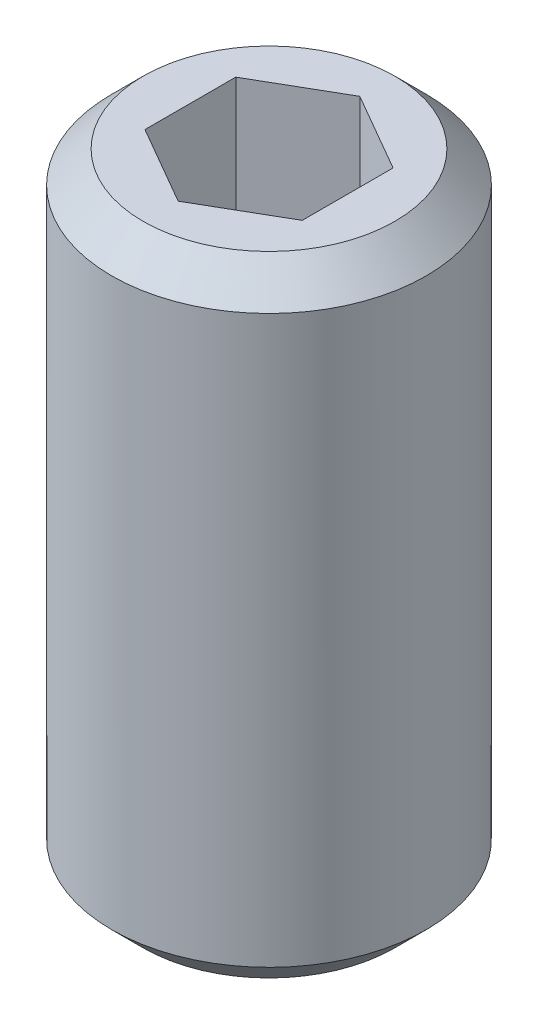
from build123d import *

# Parameters (mm, degrees)
ESQUISSE1_W             = 4
ESQUISSE1_H             = 16
CHANFREIN1_SIZE         = 0.8
CHANFREIN2_SIZE         = 0.8
ENL_V_MAT_EXTRU_1_DEPTH = 5


with BuildPart() as part:
    # Esquisse1 → Base-R_volution (revolve)
    with BuildSketch(Plane.XY, mode=Mode.PRIVATE) as base_r_volution_sk:
        with Locations((2, -8)):
            Rectangle(ESQUISSE1_W, ESQUISSE1_H)
    revolve(base_r_volution_sk.sketch.rotate(Axis((0, 0, 0), (0, -1, 0)), 90), axis=Axis((0, 0, 0), (0, -1, 0)))

    # Chanfrein1
    chanfrein1_edges = [part.edges().sort_by_distance(p)[0] for p in [
        (0, -16, -4),
    ]]
    chamfer(chanfrein1_edges, length=CHANFREIN1_SIZE)

    # Chanfrein2
    chanfrein2_edges = [part.edges().sort_by_distance(p)[0] for p in [
        (0, 0, -4),
    ]]
    chamfer(chanfrein2_edges, length=CHANFREIN2_SIZE)

    # Esquisse4 → Enl_v. mat.-Extru.1 (cut)
    with BuildSketch(Plane(origin=(0, 0, 0), x_dir=(-1, 0, 0), z_dir=(0, 1, 0))):
        Polygon((0, 2.309401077), (-2, 1.154700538), (-2, -1.154700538), (0, -2.309401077), (2, -1.154700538), (2, 1.154700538), align=None)
    extrude(amount=-ENL_V_MAT_EXTRU_1_DEPTH, mode=Mode.SUBTRACT)


solid = part.part
